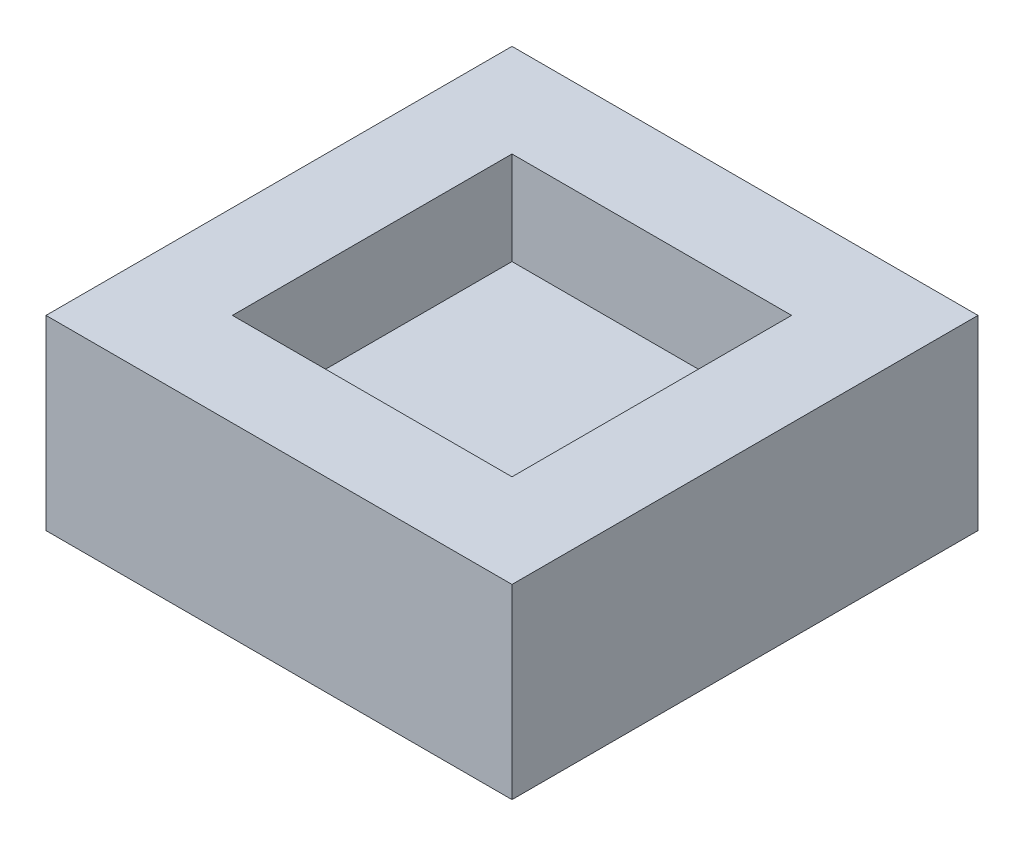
from build123d import *

# Parameters (mm, degrees)
SKETCH1_W          = 50
SKETCH1_H          = 50
EXTRUDE1_DEPTH     = 20
SKETCH2_W          = 30
SKETCH2_H          = 30
CUT_EXTRUDE1_DEPTH = 10


with BuildPart() as part:
    # Sketch1 → Extrude1 (new body)
    with BuildSketch(Plane(origin=(0, 0, 0), x_dir=(1, 0, 0), z_dir=(0, 1, 0))):
        with Locations((25, 25)):
            Rectangle(SKETCH1_W, SKETCH1_H)
    extrude(amount=EXTRUDE1_DEPTH)

    # Sketch2 → Cut-Extrude1 (cut)
    with BuildSketch(Plane(origin=(0, 20, 0), x_dir=(-1, 0, 0), z_dir=(0, 1, 0))):
        with Locations((-25, -25)):
            Rectangle(SKETCH2_W, SKETCH2_H)
    extrude(amount=-CUT_EXTRUDE1_DEPTH, mode=Mode.SUBTRACT)


solid = part.part
